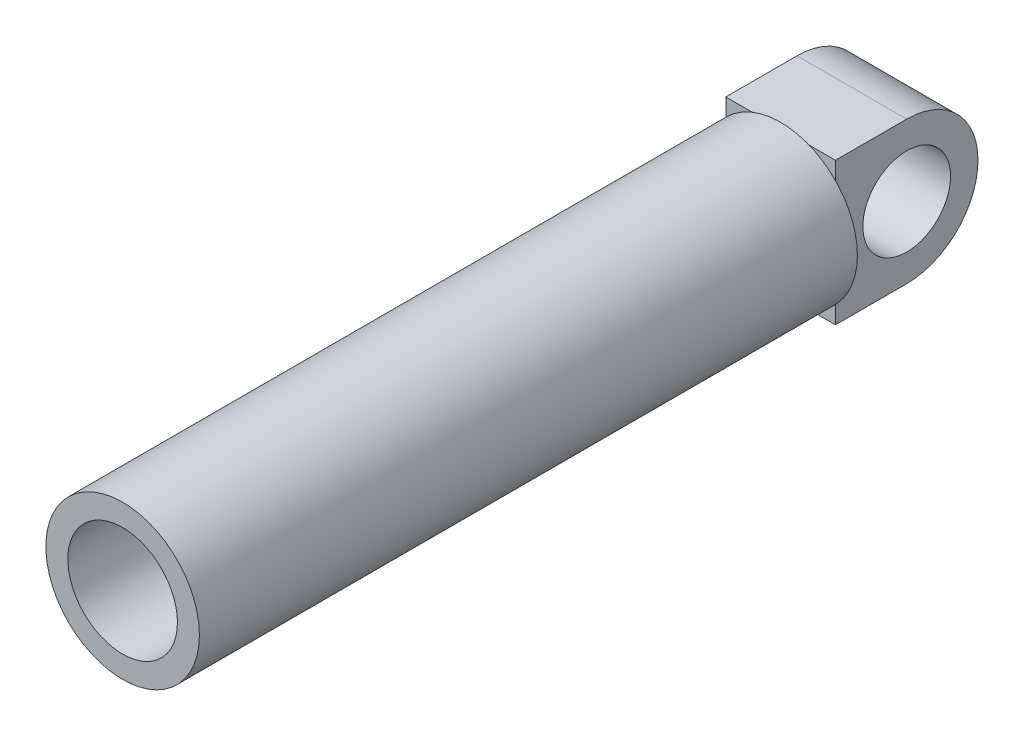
from build123d import *

# Parameters (mm, degrees)
SKETCH1_R           = 40
BOSS_EXTRUDE1_DEPTH = 50
SKETCH2_R           = 70
SKETCH2_R_2         = 50
BOSS_EXTRUDE3_DEPTH = 600


with BuildPart() as part:
    # Sketch1 → Boss-Extrude1 (new, symmetric)
    with BuildSketch(Plane(origin=(0, 0, 0), x_dir=(0, 0, -1), z_dir=(1, 0, 0))):
        with BuildLine():
            Line((-65, 65), (-65, -65))
            Line((-65, -65), (0, -65))
            ThreePointArc((0, -65), (65, 0), (0, 65))
            Line((0, 65), (-65, 65))
        make_face()
        Circle(SKETCH1_R, mode=Mode.SUBTRACT)
    extrude(amount=BOSS_EXTRUDE1_DEPTH, both=True)


with BuildPart() as body_2:
    # Sketch2 → Boss-Extrude3 (new body)
    with BuildSketch(Plane.XY.offset(65)):
        Circle(SKETCH2_R)
        Circle(SKETCH2_R_2, mode=Mode.SUBTRACT)
    extrude(amount=BOSS_EXTRUDE3_DEPTH)


solid = Compound([part.part, body_2.part])
